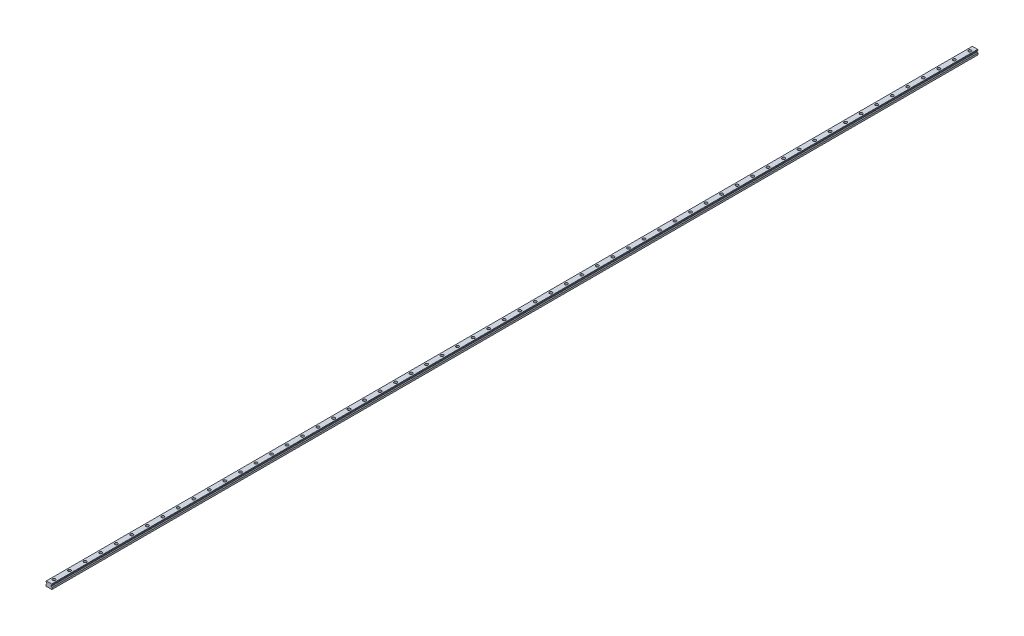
from build123d import *

# Parameters (mm, degrees)
SKETCH1_W           = 23
SKETCH1_H           = 19.2
BOSS_EXTRUDE1_DEPTH = 1790
CUT_EXTRUDE1_DEPTH  = 3581.06995602
CHAMFER1_SIZE       = 1.25
FILLET1_R           = 1.25
CUT_EXTRUDE2_DEPTH  = 3581.06995602
SKETCH4_R           = 5.5
SKETCH4_R_2         = 3.5
CUT_EXTRUDE3_DEPTH  = 9
SKETCH4_2_R         = 3.5
CUT_EXTRUDE4_DEPTH  = 1791.13990794
LPATTERN1_COUNT     = 60
LPATTERN1_PITCH     = 60


with BuildPart() as part:
    # Sketch1 → Boss-Extrude1 (new, symmetric)
    with BuildSketch(Plane.XY):
        with Locations((0, 9.6)):
            Rectangle(SKETCH1_W, SKETCH1_H)
    extrude(amount=BOSS_EXTRUDE1_DEPTH, both=True)

    # Sketch2 → Cut-Extrude1 (cut, through all)
    with BuildSketch(Plane.XY.offset(1790)):
        Polygon((-11.5, 16.7), (-11.5, 7.95), (-8.583333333, 10.866666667), (-8.583333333, 13.783333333), align=None)
        Polygon((8.583333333, 13.783333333), (11.5, 16.7), (11.5, 7.95), (8.583333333, 10.866666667), align=None)
    extrude(amount=-CUT_EXTRUDE1_DEPTH, mode=Mode.SUBTRACT)

    # Chamfer1
    chamfer1_edges = [part.edges().sort_by_distance(p)[0] for p in [
        (-11.5, 19.2, 0),
        (11.5, 19.2, 0),
        (11.5, 0, 0),
        (-11.5, 0, 0),
    ]]
    chamfer(chamfer1_edges, length=CHAMFER1_SIZE)

    # Fillet1
    fillet1_edges = [part.edges().sort_by_distance(p)[0] for p in [
        (-8.583333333, 13.783333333, 0),
        (-8.583333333, 10.866666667, 0),
        (8.583333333, 10.866666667, 0),
        (8.583333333, 13.783333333, 0),
    ]]
    fillet(fillet1_edges, radius=FILLET1_R)

    # Sketch3 → Cut-Extrude2 (cut, through all)
    with BuildSketch(Plane.XY.offset(1790)):
        Polygon((-7, 0), (-5.75, 1.25), (5.75, 1.25), (7, 0), align=None)
    extrude(amount=-CUT_EXTRUDE2_DEPTH, mode=Mode.SUBTRACT)

    # Sketch4 → Cut-Extrude3 (cut)
    with BuildSketch(Plane(origin=(0, 19.2, 0), x_dir=(1, 0, 0), z_dir=(0, 1, 0))):
        with Locations(Location((0, -1770, 0), (0, 0, 270))):
            Circle(SKETCH4_R)
        with Locations(Location((0, -1770, 0), (0, 0, 270))):
            Circle(SKETCH4_R_2, mode=Mode.SUBTRACT)
    cut_extrude3 = extrude(amount=-CUT_EXTRUDE3_DEPTH, mode=Mode.SUBTRACT)

    # Sketch4_2 → Cut-Extrude4 (cut, through all)
    with BuildSketch(Plane(origin=(0, 19.2, 0), x_dir=(1, 0, 0), z_dir=(0, 1, 0))):
        with Locations(Location((0, -1770, 0), (0, 0, 270))):
            Circle(SKETCH4_2_R)
    cut_extrude4 = extrude(amount=-CUT_EXTRUDE4_DEPTH, mode=Mode.SUBTRACT)

    # LPattern1: Cut-Extrude3, Cut-Extrude4 ×60
    with Locations(*[(0, 0, -i * LPATTERN1_PITCH) for i in range(1, LPATTERN1_COUNT)]):
        add(cut_extrude3, mode=Mode.SUBTRACT)
        add(cut_extrude4, mode=Mode.SUBTRACT)


solid = part.part
